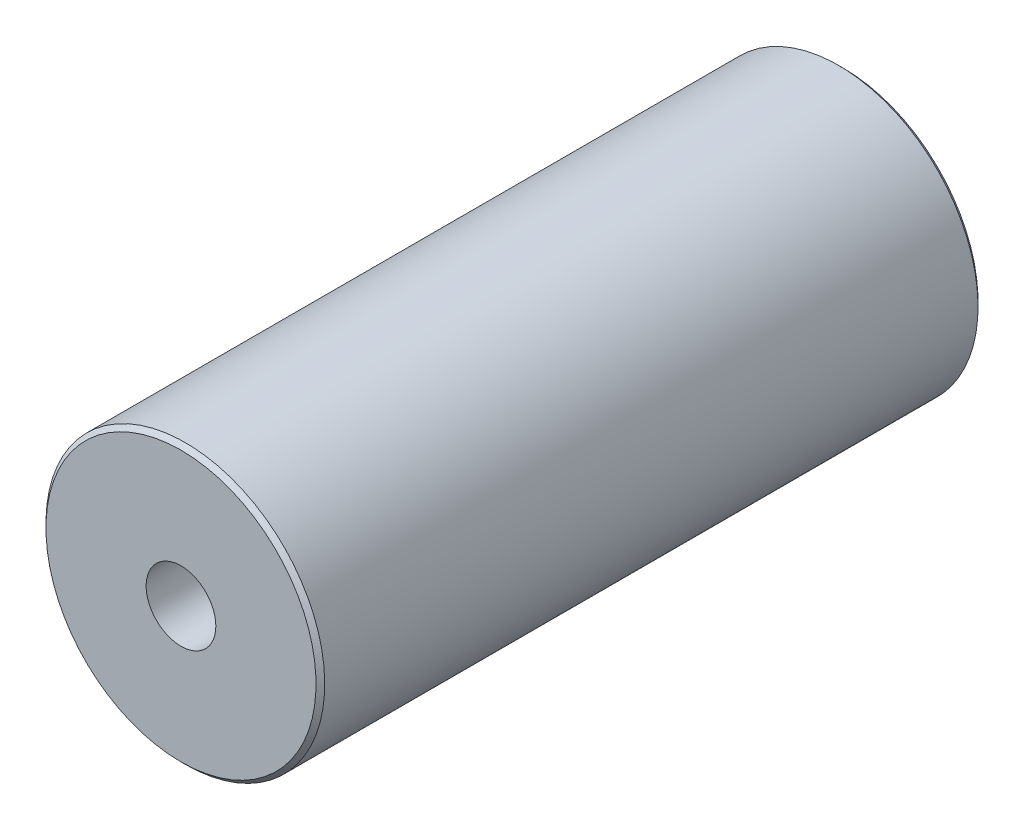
ISO-10303-21;
HEADER;
FILE_DESCRIPTION(('STEP AP214'),'2;1');
FILE_NAME('part.step','',(''),(''),'','','');
FILE_SCHEMA(('AUTOMOTIVE_DESIGN { 1 0 10303 214 1 1 1 1 }'));
ENDSEC;
DATA;
#1=APPLICATION_CONTEXT('core data for automotive mechanical design processes');
#2=APPLICATION_PROTOCOL_DEFINITION('international standard','automotive_design',2000,#1);
#3=PRODUCT_CONTEXT('',#1,'mechanical');
#4=PRODUCT('Part','Part','',(#3));
#5=PRODUCT_RELATED_PRODUCT_CATEGORY('part','',(#4));
#6=PRODUCT_DEFINITION_FORMATION('','',#4);
#7=PRODUCT_DEFINITION_CONTEXT('part definition',#1,'design');
#8=PRODUCT_DEFINITION('design','',#6,#7);
#9=PRODUCT_DEFINITION_SHAPE('','',#8);
#10=(LENGTH_UNIT() NAMED_UNIT(*) SI_UNIT(.MILLI.,.METRE.));
#11=(NAMED_UNIT(*) PLANE_ANGLE_UNIT() SI_UNIT($,.RADIAN.));
#12=(NAMED_UNIT(*) SI_UNIT($,.STERADIAN.) SOLID_ANGLE_UNIT());
#13=UNCERTAINTY_MEASURE_WITH_UNIT(LENGTH_MEASURE(1.E-05),#10,'distance_accuracy_value','');
#14=(GEOMETRIC_REPRESENTATION_CONTEXT(3) GLOBAL_UNCERTAINTY_ASSIGNED_CONTEXT((#13)) GLOBAL_UNIT_ASSIGNED_CONTEXT((#10,
#11,#12)) REPRESENTATION_CONTEXT('',''));
#15=CARTESIAN_POINT('',(0.,0.,0.));
#16=DIRECTION('',(0.,0.,1.));
#17=DIRECTION('',(1.,0.,0.));
#18=AXIS2_PLACEMENT_3D('',#15,#16,#17);
#19=CARTESIAN_POINT('',(0.,0.,0.));
#20=DIRECTION('',(0.,0.,-1.));
#21=DIRECTION('',(0.,1.,0.));
#22=AXIS2_PLACEMENT_3D('',#19,#20,#21);
#23=PLANE('',#22);
#24=CARTESIAN_POINT('',(0.,0.,0.));
#25=DIRECTION('',(0.,0.,1.));
#26=DIRECTION('',(1.,0.,0.));
#27=AXIS2_PLACEMENT_3D('',#24,#25,#26);
#28=CIRCLE('',#27,4.);
#29=CARTESIAN_POINT('',(4.,0.,0.));
#30=VERTEX_POINT('',#29);
#31=EDGE_CURVE('E126',#30,#30,#28,.T.);
#32=ORIENTED_EDGE('',*,*,#31,.F.);
#33=EDGE_LOOP('',(#32));
#34=FACE_BOUND('',#33,.T.);
#35=CARTESIAN_POINT('',(0.,0.,0.));
#36=DIRECTION('',(0.,0.,1.));
#37=DIRECTION('',(0.,-1.,0.));
#38=AXIS2_PLACEMENT_3D('',#35,#36,#37);
#39=CIRCLE('',#38,15.5);
#40=CARTESIAN_POINT('',(0.,-15.5,0.));
#41=VERTEX_POINT('',#40);
#42=EDGE_CURVE('E11',#41,#41,#39,.T.);
#43=ORIENTED_EDGE('',*,*,#42,.T.);
#44=EDGE_LOOP('',(#43));
#45=FACE_BOUND('',#44,.T.);
#46=ADVANCED_FACE('F34',(#34,#45),#23,.F.);
#47=CARTESIAN_POINT('',(0.,0.,-0.500000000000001));
#48=DIRECTION('',(0.,0.,-1.));
#49=DIRECTION('',(0.,1.,0.));
#50=AXIS2_PLACEMENT_3D('',#47,#48,#49);
#51=CONICAL_SURFACE('',#50,16.,0.785398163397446);
#52=ORIENTED_EDGE('',*,*,#42,.F.);
#53=EDGE_LOOP('',(#52));
#54=FACE_BOUND('',#53,.T.);
#55=CARTESIAN_POINT('',(0.,0.,-0.500000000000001));
#56=DIRECTION('',(0.,0.,1.));
#57=DIRECTION('',(0.,-1.,0.));
#58=AXIS2_PLACEMENT_3D('',#55,#56,#57);
#59=CIRCLE('',#58,16.);
#60=CARTESIAN_POINT('',(0.,-16.,-0.500000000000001));
#61=VERTEX_POINT('',#60);
#62=EDGE_CURVE('E41',#61,#61,#59,.T.);
#63=ORIENTED_EDGE('',*,*,#62,.T.);
#64=EDGE_LOOP('',(#63));
#65=FACE_BOUND('',#64,.T.);
#66=ADVANCED_FACE('F81',(#54,#65),#51,.T.);
#67=CARTESIAN_POINT('',(0.,0.,0.));
#68=DIRECTION('',(0.,0.,1.));
#69=DIRECTION('',(0.,-1.,0.));
#70=AXIS2_PLACEMENT_3D('',#67,#68,#69);
#71=CYLINDRICAL_SURFACE('',#70,16.);
#72=ORIENTED_EDGE('',*,*,#62,.F.);
#73=EDGE_LOOP('',(#72));
#74=FACE_BOUND('',#73,.T.);
#75=CARTESIAN_POINT('',(0.,0.,-75.5));
#76=DIRECTION('',(0.,0.,1.));
#77=DIRECTION('',(0.,-1.,0.));
#78=AXIS2_PLACEMENT_3D('',#75,#76,#77);
#79=CIRCLE('',#78,16.);
#80=CARTESIAN_POINT('',(0.,-16.,-75.5));
#81=VERTEX_POINT('',#80);
#82=EDGE_CURVE('E76',#81,#81,#79,.T.);
#83=ORIENTED_EDGE('',*,*,#82,.T.);
#84=EDGE_LOOP('',(#83));
#85=FACE_BOUND('',#84,.T.);
#86=ADVANCED_FACE('F83',(#74,#85),#71,.T.);
#87=CARTESIAN_POINT('',(0.,0.,-76.));
#88=DIRECTION('',(0.,0.,1.));
#89=DIRECTION('',(0.,-1.,0.));
#90=AXIS2_PLACEMENT_3D('',#87,#88,#89);
#91=CONICAL_SURFACE('',#90,15.5,0.785398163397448);
#92=ORIENTED_EDGE('',*,*,#82,.F.);
#93=EDGE_LOOP('',(#92));
#94=FACE_BOUND('',#93,.T.);
#95=CARTESIAN_POINT('',(0.,0.,-76.));
#96=DIRECTION('',(0.,0.,1.));
#97=DIRECTION('',(0.,-1.,0.));
#98=AXIS2_PLACEMENT_3D('',#95,#96,#97);
#99=CIRCLE('',#98,15.5);
#100=CARTESIAN_POINT('',(0.,-15.5,-76.));
#101=VERTEX_POINT('',#100);
#102=EDGE_CURVE('E73',#101,#101,#99,.T.);
#103=ORIENTED_EDGE('',*,*,#102,.T.);
#104=EDGE_LOOP('',(#103));
#105=FACE_BOUND('',#104,.T.);
#106=ADVANCED_FACE('F86',(#94,#105),#91,.T.);
#107=CARTESIAN_POINT('',(0.,15.5,-76.));
#108=DIRECTION('',(0.,0.,1.));
#109=DIRECTION('',(0.,-1.,0.));
#110=AXIS2_PLACEMENT_3D('',#107,#108,#109);
#111=PLANE('',#110);
#112=ORIENTED_EDGE('',*,*,#102,.F.);
#113=EDGE_LOOP('',(#112));
#114=FACE_BOUND('',#113,.T.);
#115=CARTESIAN_POINT('',(0.,0.,-76.));
#116=DIRECTION('',(0.,0.,1.));
#117=DIRECTION('',(0.,-1.,0.));
#118=AXIS2_PLACEMENT_3D('',#115,#116,#117);
#119=CIRCLE('',#118,4.5);
#120=CARTESIAN_POINT('',(0.,-4.5,-76.));
#121=VERTEX_POINT('',#120);
#122=EDGE_CURVE('E70',#121,#121,#119,.T.);
#123=ORIENTED_EDGE('',*,*,#122,.T.);
#124=EDGE_LOOP('',(#123));
#125=FACE_BOUND('',#124,.T.);
#126=ADVANCED_FACE('F92',(#114,#125),#111,.F.);
#127=CARTESIAN_POINT('',(0.,0.,-75.5));
#128=DIRECTION('',(0.,0.,-1.));
#129=DIRECTION('',(0.,1.,0.));
#130=AXIS2_PLACEMENT_3D('',#127,#128,#129);
#131=CONICAL_SURFACE('',#130,4.,0.785398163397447);
#132=ORIENTED_EDGE('',*,*,#122,.F.);
#133=EDGE_LOOP('',(#132));
#134=FACE_BOUND('',#133,.T.);
#135=CARTESIAN_POINT('',(0.,0.,-75.5));
#136=DIRECTION('',(0.,0.,1.));
#137=DIRECTION('',(0.,-1.,0.));
#138=AXIS2_PLACEMENT_3D('',#135,#136,#137);
#139=CIRCLE('',#138,4.);
#140=CARTESIAN_POINT('',(0.,-4.,-75.5));
#141=VERTEX_POINT('',#140);
#142=EDGE_CURVE('E61',#141,#141,#139,.T.);
#143=ORIENTED_EDGE('',*,*,#142,.T.);
#144=EDGE_LOOP('',(#143));
#145=FACE_BOUND('',#144,.T.);
#146=ADVANCED_FACE('F98',(#134,#145),#131,.F.);
#147=CARTESIAN_POINT('',(0.,0.,0.));
#148=DIRECTION('',(0.,0.,1.));
#149=DIRECTION('',(0.,-1.,0.));
#150=AXIS2_PLACEMENT_3D('',#147,#148,#149);
#151=CYLINDRICAL_SURFACE('',#150,4.);
#152=ORIENTED_EDGE('',*,*,#142,.F.);
#153=EDGE_LOOP('',(#152));
#154=FACE_BOUND('',#153,.T.);
#155=CARTESIAN_POINT('',(0.,0.,-61.));
#156=DIRECTION('',(0.,0.,1.));
#157=DIRECTION('',(0.,-1.,0.));
#158=AXIS2_PLACEMENT_3D('',#155,#156,#157);
#159=CIRCLE('',#158,4.);
#160=CARTESIAN_POINT('',(0.,-4.,-61.));
#161=VERTEX_POINT('',#160);
#162=EDGE_CURVE('E57',#161,#161,#159,.T.);
#163=ORIENTED_EDGE('',*,*,#162,.T.);
#164=EDGE_LOOP('',(#163));
#165=FACE_BOUND('',#164,.T.);
#166=ADVANCED_FACE('F104',(#154,#165),#151,.F.);
#167=CARTESIAN_POINT('',(0.,0.,-58.6905989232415));
#168=DIRECTION('',(0.,0.,-1.));
#169=DIRECTION('',(0.,1.,0.));
#170=AXIS2_PLACEMENT_3D('',#167,#168,#169);
#171=CONICAL_SURFACE('',#170,0.,1.0471975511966);
#172=ORIENTED_EDGE('',*,*,#162,.F.);
#173=EDGE_LOOP('',(#172));
#174=FACE_BOUND('',#173,.T.);
#175=CARTESIAN_POINT('',(0.,0.,-58.6905989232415));
#176=VERTEX_POINT('',#175);
#177=VERTEX_LOOP('',#176);
#178=FACE_BOUND('',#177,.T.);
#179=ADVANCED_FACE('F51',(#174,#178),#171,.F.);
#180=CARTESIAN_POINT('',(0.,0.,-18.));
#181=DIRECTION('',(0.,0.,1.));
#182=DIRECTION('',(1.,0.,0.));
#183=AXIS2_PLACEMENT_3D('',#180,#181,#182);
#184=CONICAL_SURFACE('',#183,3.4,1.0471975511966);
#185=CARTESIAN_POINT('',(0.,0.,-19.9629909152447));
#186=VERTEX_POINT('',#185);
#187=VERTEX_LOOP('',#186);
#188=FACE_BOUND('',#187,.T.);
#189=CARTESIAN_POINT('',(0.,0.,-18.));
#190=DIRECTION('',(0.,0.,1.));
#191=DIRECTION('',(1.,0.,0.));
#192=AXIS2_PLACEMENT_3D('',#189,#190,#191);
#193=CIRCLE('',#192,3.4);
#194=CARTESIAN_POINT('',(3.4,0.,-18.));
#195=VERTEX_POINT('',#194);
#196=EDGE_CURVE('E55',#195,#195,#193,.T.);
#197=ORIENTED_EDGE('',*,*,#196,.T.);
#198=EDGE_LOOP('',(#197));
#199=FACE_BOUND('',#198,.T.);
#200=ADVANCED_FACE('F47',(#188,#199),#184,.F.);
#201=CARTESIAN_POINT('',(0.,0.,0.));
#202=DIRECTION('',(0.,0.,1.));
#203=DIRECTION('',(1.,0.,0.));
#204=AXIS2_PLACEMENT_3D('',#201,#202,#203);
#205=CYLINDRICAL_SURFACE('',#204,3.4);
#206=ORIENTED_EDGE('',*,*,#196,.F.);
#207=EDGE_LOOP('',(#206));
#208=FACE_BOUND('',#207,.T.);
#209=CARTESIAN_POINT('',(0.,0.,-15.));
#210=DIRECTION('',(0.,0.,1.));
#211=DIRECTION('',(1.,0.,0.));
#212=AXIS2_PLACEMENT_3D('',#209,#210,#211);
#213=CIRCLE('',#212,3.4);
#214=CARTESIAN_POINT('',(3.4,0.,-15.));
#215=VERTEX_POINT('',#214);
#216=EDGE_CURVE('E58',#215,#215,#213,.T.);
#217=ORIENTED_EDGE('',*,*,#216,.T.);
#218=EDGE_LOOP('',(#217));
#219=FACE_BOUND('',#218,.T.);
#220=ADVANCED_FACE('F50',(#208,#219),#205,.F.);
#221=CARTESIAN_POINT('',(3.4,0.,-15.));
#222=DIRECTION('',(0.,0.,-1.));
#223=DIRECTION('',(-1.,0.,0.));
#224=AXIS2_PLACEMENT_3D('',#221,#222,#223);
#225=PLANE('',#224);
#226=ORIENTED_EDGE('',*,*,#216,.F.);
#227=EDGE_LOOP('',(#226));
#228=FACE_BOUND('',#227,.T.);
#229=CARTESIAN_POINT('',(0.,0.,-15.));
#230=DIRECTION('',(0.,0.,1.));
#231=DIRECTION('',(1.,0.,0.));
#232=AXIS2_PLACEMENT_3D('',#229,#230,#231);
#233=CIRCLE('',#232,4.);
#234=CARTESIAN_POINT('',(4.,0.,-15.));
#235=VERTEX_POINT('',#234);
#236=EDGE_CURVE('E64',#235,#235,#233,.T.);
#237=ORIENTED_EDGE('',*,*,#236,.T.);
#238=EDGE_LOOP('',(#237));
#239=FACE_BOUND('',#238,.T.);
#240=ADVANCED_FACE('F133',(#228,#239),#225,.F.);
#241=CARTESIAN_POINT('',(0.,0.,0.));
#242=DIRECTION('',(0.,0.,1.));
#243=DIRECTION('',(1.,0.,0.));
#244=AXIS2_PLACEMENT_3D('',#241,#242,#243);
#245=CYLINDRICAL_SURFACE('',#244,4.);
#246=ORIENTED_EDGE('',*,*,#236,.F.);
#247=EDGE_LOOP('',(#246));
#248=FACE_BOUND('',#247,.T.);
#249=ORIENTED_EDGE('',*,*,#31,.T.);
#250=EDGE_LOOP('',(#249));
#251=FACE_BOUND('',#250,.T.);
#252=ADVANCED_FACE('F135',(#248,#251),#245,.F.);
#253=CLOSED_SHELL('',(#46,#66,#86,#106,#126,#146,#166,#179,#200,#220,#240,#252));
#254=MANIFOLD_SOLID_BREP('B2',#253);
#255=ADVANCED_BREP_SHAPE_REPRESENTATION('',(#18,#254),#14);
#256=SHAPE_DEFINITION_REPRESENTATION(#9,#255);
ENDSEC;
END-ISO-10303-21;
